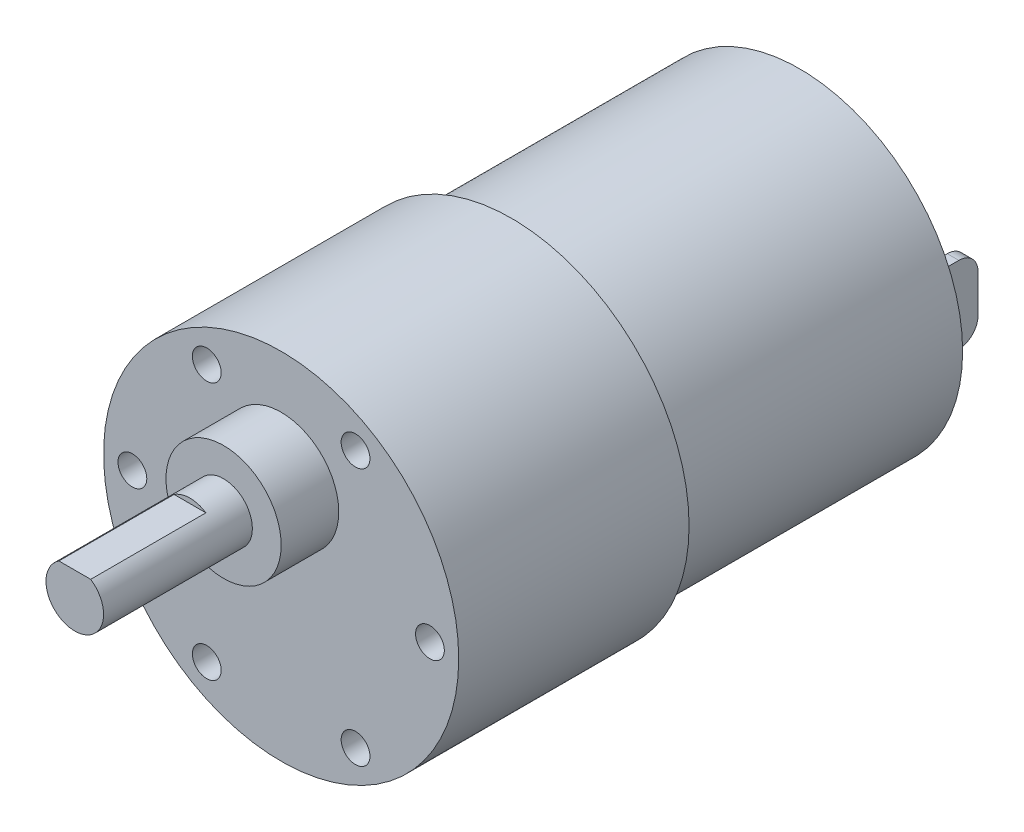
ISO-10303-21;
HEADER;
FILE_DESCRIPTION(('STEP AP214'),'2;1');
FILE_NAME('part.step','',(''),(''),'','','');
FILE_SCHEMA(('AUTOMOTIVE_DESIGN { 1 0 10303 214 1 1 1 1 }'));
ENDSEC;
DATA;
#1=APPLICATION_CONTEXT('core data for automotive mechanical design processes');
#2=APPLICATION_PROTOCOL_DEFINITION('international standard','automotive_design',2000,#1);
#3=PRODUCT_CONTEXT('',#1,'mechanical');
#4=PRODUCT('Part','Part','',(#3));
#5=PRODUCT_RELATED_PRODUCT_CATEGORY('part','',(#4));
#6=PRODUCT_DEFINITION_FORMATION('','',#4);
#7=PRODUCT_DEFINITION_CONTEXT('part definition',#1,'design');
#8=PRODUCT_DEFINITION('design','',#6,#7);
#9=PRODUCT_DEFINITION_SHAPE('','',#8);
#10=(LENGTH_UNIT() NAMED_UNIT(*) SI_UNIT(.MILLI.,.METRE.));
#11=(NAMED_UNIT(*) PLANE_ANGLE_UNIT() SI_UNIT($,.RADIAN.));
#12=(NAMED_UNIT(*) SI_UNIT($,.STERADIAN.) SOLID_ANGLE_UNIT());
#13=UNCERTAINTY_MEASURE_WITH_UNIT(LENGTH_MEASURE(1.E-05),#10,'distance_accuracy_value','');
#14=(GEOMETRIC_REPRESENTATION_CONTEXT(3) GLOBAL_UNCERTAINTY_ASSIGNED_CONTEXT((#13)) GLOBAL_UNIT_ASSIGNED_CONTEXT((#10,
#11,#12)) REPRESENTATION_CONTEXT('',''));
#15=CARTESIAN_POINT('',(0.,0.,0.));
#16=DIRECTION('',(0.,0.,1.));
#17=DIRECTION('',(1.,0.,0.));
#18=AXIS2_PLACEMENT_3D('',#15,#16,#17);
#19=CARTESIAN_POINT('',(0.,0.,24.));
#20=DIRECTION('',(0.,0.,1.));
#21=DIRECTION('',(1.,0.,0.));
#22=AXIS2_PLACEMENT_3D('',#19,#20,#21);
#23=PLANE('',#22);
#24=CARTESIAN_POINT('',(0.,0.,24.));
#25=DIRECTION('',(0.,0.,1.));
#26=DIRECTION('',(-1.,0.,0.));
#27=AXIS2_PLACEMENT_3D('',#24,#25,#26);
#28=CIRCLE('',#27,18.5);
#29=CARTESIAN_POINT('',(18.5,0.,24.));
#30=VERTEX_POINT('',#29);
#31=EDGE_CURVE('E24',#30,#30,#28,.T.);
#32=ORIENTED_EDGE('',*,*,#31,.T.);
#33=EDGE_LOOP('',(#32));
#34=FACE_BOUND('',#33,.T.);
#35=CARTESIAN_POINT('',(-15.5,0.,24.));
#36=DIRECTION('',(0.,0.,-1.));
#37=DIRECTION('',(-1.,0.,0.));
#38=AXIS2_PLACEMENT_3D('',#35,#36,#37);
#39=CIRCLE('',#38,1.5);
#40=CARTESIAN_POINT('',(-14.,0.,24.));
#41=VERTEX_POINT('',#40);
#42=EDGE_CURVE('E261',#41,#41,#39,.T.);
#43=ORIENTED_EDGE('',*,*,#42,.T.);
#44=EDGE_LOOP('',(#43));
#45=FACE_BOUND('',#44,.T.);
#46=CARTESIAN_POINT('',(-7.75,-13.4233937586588,24.));
#47=DIRECTION('',(0.,0.,-1.));
#48=DIRECTION('',(-1.,0.,0.));
#49=AXIS2_PLACEMENT_3D('',#46,#47,#48);
#50=CIRCLE('',#49,1.5);
#51=CARTESIAN_POINT('',(-6.25,-13.4233937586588,24.));
#52=VERTEX_POINT('',#51);
#53=EDGE_CURVE('E205',#52,#52,#50,.T.);
#54=ORIENTED_EDGE('',*,*,#53,.T.);
#55=EDGE_LOOP('',(#54));
#56=FACE_BOUND('',#55,.T.);
#57=CARTESIAN_POINT('',(7.75,-13.4233937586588,24.));
#58=DIRECTION('',(0.,0.,-1.));
#59=DIRECTION('',(-1.,0.,0.));
#60=AXIS2_PLACEMENT_3D('',#57,#58,#59);
#61=CIRCLE('',#60,1.5);
#62=CARTESIAN_POINT('',(9.25,-13.4233937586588,24.));
#63=VERTEX_POINT('',#62);
#64=EDGE_CURVE('E325',#63,#63,#61,.T.);
#65=ORIENTED_EDGE('',*,*,#64,.T.);
#66=EDGE_LOOP('',(#65));
#67=FACE_BOUND('',#66,.T.);
#68=CARTESIAN_POINT('',(15.5,0.,24.));
#69=DIRECTION('',(0.,0.,-1.));
#70=DIRECTION('',(-1.,0.,0.));
#71=AXIS2_PLACEMENT_3D('',#68,#69,#70);
#72=CIRCLE('',#71,1.5);
#73=CARTESIAN_POINT('',(17.,0.,24.));
#74=VERTEX_POINT('',#73);
#75=EDGE_CURVE('E227',#74,#74,#72,.T.);
#76=ORIENTED_EDGE('',*,*,#75,.T.);
#77=EDGE_LOOP('',(#76));
#78=FACE_BOUND('',#77,.T.);
#79=CARTESIAN_POINT('',(7.75,13.4233937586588,24.));
#80=DIRECTION('',(0.,0.,-1.));
#81=DIRECTION('',(-1.,0.,0.));
#82=AXIS2_PLACEMENT_3D('',#79,#80,#81);
#83=CIRCLE('',#82,1.5);
#84=CARTESIAN_POINT('',(9.25,13.4233937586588,24.));
#85=VERTEX_POINT('',#84);
#86=EDGE_CURVE('E225',#85,#85,#83,.T.);
#87=ORIENTED_EDGE('',*,*,#86,.T.);
#88=EDGE_LOOP('',(#87));
#89=FACE_BOUND('',#88,.T.);
#90=CARTESIAN_POINT('',(-7.75,13.4233937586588,24.));
#91=DIRECTION('',(0.,0.,-1.));
#92=DIRECTION('',(-1.,0.,0.));
#93=AXIS2_PLACEMENT_3D('',#90,#91,#92);
#94=CIRCLE('',#93,1.5);
#95=CARTESIAN_POINT('',(-6.25,13.4233937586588,24.));
#96=VERTEX_POINT('',#95);
#97=EDGE_CURVE('E228',#96,#96,#94,.T.);
#98=ORIENTED_EDGE('',*,*,#97,.T.);
#99=EDGE_LOOP('',(#98));
#100=FACE_BOUND('',#99,.T.);
#101=CARTESIAN_POINT('',(0.,7.,24.));
#102=DIRECTION('',(0.,0.,-1.));
#103=DIRECTION('',(-1.,0.,0.));
#104=AXIS2_PLACEMENT_3D('',#101,#102,#103);
#105=CIRCLE('',#104,6.);
#106=CARTESIAN_POINT('',(6.,7.,24.));
#107=VERTEX_POINT('',#106);
#108=EDGE_CURVE('E303',#107,#107,#105,.T.);
#109=ORIENTED_EDGE('',*,*,#108,.T.);
#110=EDGE_LOOP('',(#109));
#111=FACE_BOUND('',#110,.T.);
#112=ADVANCED_FACE('F16',(#34,#45,#56,#67,#78,#89,#100,#111),#23,.T.);
#113=CARTESIAN_POINT('',(0.,0.,0.));
#114=DIRECTION('',(0.,0.,1.));
#115=DIRECTION('',(1.,0.,0.));
#116=AXIS2_PLACEMENT_3D('',#113,#114,#115);
#117=PLANE('',#116);
#118=CARTESIAN_POINT('',(0.,0.,0.));
#119=DIRECTION('',(0.,0.,-1.));
#120=DIRECTION('',(-1.,0.,0.));
#121=AXIS2_PLACEMENT_3D('',#118,#119,#120);
#122=CIRCLE('',#121,18.5);
#123=CARTESIAN_POINT('',(18.5,0.,0.));
#124=VERTEX_POINT('',#123);
#125=EDGE_CURVE('E10',#124,#124,#122,.T.);
#126=ORIENTED_EDGE('',*,*,#125,.T.);
#127=EDGE_LOOP('',(#126));
#128=FACE_BOUND('',#127,.T.);
#129=CARTESIAN_POINT('',(0.,0.,0.));
#130=DIRECTION('',(0.,0.,1.));
#131=DIRECTION('',(1.,0.,0.));
#132=AXIS2_PLACEMENT_3D('',#129,#130,#131);
#133=CIRCLE('',#132,17.);
#134=CARTESIAN_POINT('',(-17.,0.,0.));
#135=VERTEX_POINT('',#134);
#136=EDGE_CURVE('E314',#135,#135,#133,.T.);
#137=ORIENTED_EDGE('',*,*,#136,.T.);
#138=EDGE_LOOP('',(#137));
#139=FACE_BOUND('',#138,.T.);
#140=ADVANCED_FACE('F373',(#128,#139),#117,.F.);
#141=CARTESIAN_POINT('',(0.,0.,0.));
#142=DIRECTION('',(0.,0.,-1.));
#143=DIRECTION('',(-1.,0.,0.));
#144=AXIS2_PLACEMENT_3D('',#141,#142,#143);
#145=CYLINDRICAL_SURFACE('',#144,18.5);
#146=ORIENTED_EDGE('',*,*,#125,.F.);
#147=EDGE_LOOP('',(#146));
#148=FACE_BOUND('',#147,.T.);
#149=ORIENTED_EDGE('',*,*,#31,.F.);
#150=EDGE_LOOP('',(#149));
#151=FACE_BOUND('',#150,.T.);
#152=ADVANCED_FACE('F377',(#148,#151),#145,.T.);
#153=CARTESIAN_POINT('',(-15.5,0.,0.));
#154=DIRECTION('',(0.,0.,-1.));
#155=DIRECTION('',(-1.,0.,0.));
#156=AXIS2_PLACEMENT_3D('',#153,#154,#155);
#157=CYLINDRICAL_SURFACE('',#156,1.5);
#158=ORIENTED_EDGE('',*,*,#42,.F.);
#159=EDGE_LOOP('',(#158));
#160=FACE_BOUND('',#159,.T.);
#161=CARTESIAN_POINT('',(-15.5,0.,12.));
#162=DIRECTION('',(0.,0.,-1.));
#163=DIRECTION('',(-1.,0.,0.));
#164=AXIS2_PLACEMENT_3D('',#161,#162,#163);
#165=CIRCLE('',#164,1.5);
#166=CARTESIAN_POINT('',(-17.,0.,12.));
#167=VERTEX_POINT('',#166);
#168=EDGE_CURVE('E320',#167,#167,#165,.T.);
#169=ORIENTED_EDGE('',*,*,#168,.T.);
#170=EDGE_LOOP('',(#169));
#171=FACE_BOUND('',#170,.T.);
#172=ADVANCED_FACE('F351',(#160,#171),#157,.F.);
#173=CARTESIAN_POINT('',(-7.75,-13.4233937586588,0.));
#174=DIRECTION('',(0.,0.,-1.));
#175=DIRECTION('',(-1.,0.,0.));
#176=AXIS2_PLACEMENT_3D('',#173,#174,#175);
#177=CYLINDRICAL_SURFACE('',#176,1.5);
#178=ORIENTED_EDGE('',*,*,#53,.F.);
#179=EDGE_LOOP('',(#178));
#180=FACE_BOUND('',#179,.T.);
#181=CARTESIAN_POINT('',(-7.75,-13.4233937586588,12.));
#182=DIRECTION('',(0.,0.,-1.));
#183=DIRECTION('',(-1.,0.,0.));
#184=AXIS2_PLACEMENT_3D('',#181,#182,#183);
#185=CIRCLE('',#184,1.5);
#186=CARTESIAN_POINT('',(-9.25,-13.4233937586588,12.));
#187=VERTEX_POINT('',#186);
#188=EDGE_CURVE('E210',#187,#187,#185,.T.);
#189=ORIENTED_EDGE('',*,*,#188,.T.);
#190=EDGE_LOOP('',(#189));
#191=FACE_BOUND('',#190,.T.);
#192=ADVANCED_FACE('F347',(#180,#191),#177,.F.);
#193=CARTESIAN_POINT('',(7.75,-13.4233937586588,0.));
#194=DIRECTION('',(0.,0.,-1.));
#195=DIRECTION('',(-1.,0.,0.));
#196=AXIS2_PLACEMENT_3D('',#193,#194,#195);
#197=CYLINDRICAL_SURFACE('',#196,1.5);
#198=ORIENTED_EDGE('',*,*,#64,.F.);
#199=EDGE_LOOP('',(#198));
#200=FACE_BOUND('',#199,.T.);
#201=CARTESIAN_POINT('',(7.75,-13.4233937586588,12.));
#202=DIRECTION('',(0.,0.,-1.));
#203=DIRECTION('',(-1.,0.,0.));
#204=AXIS2_PLACEMENT_3D('',#201,#202,#203);
#205=CIRCLE('',#204,1.5);
#206=CARTESIAN_POINT('',(6.25,-13.4233937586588,12.));
#207=VERTEX_POINT('',#206);
#208=EDGE_CURVE('E318',#207,#207,#205,.T.);
#209=ORIENTED_EDGE('',*,*,#208,.T.);
#210=EDGE_LOOP('',(#209));
#211=FACE_BOUND('',#210,.T.);
#212=ADVANCED_FACE('F350',(#200,#211),#197,.F.);
#213=CARTESIAN_POINT('',(15.5,0.,0.));
#214=DIRECTION('',(0.,0.,-1.));
#215=DIRECTION('',(-1.,0.,0.));
#216=AXIS2_PLACEMENT_3D('',#213,#214,#215);
#217=CYLINDRICAL_SURFACE('',#216,1.5);
#218=ORIENTED_EDGE('',*,*,#75,.F.);
#219=EDGE_LOOP('',(#218));
#220=FACE_BOUND('',#219,.T.);
#221=CARTESIAN_POINT('',(15.5,0.,12.));
#222=DIRECTION('',(0.,0.,-1.));
#223=DIRECTION('',(-1.,0.,0.));
#224=AXIS2_PLACEMENT_3D('',#221,#222,#223);
#225=CIRCLE('',#224,1.5);
#226=CARTESIAN_POINT('',(14.,0.,12.));
#227=VERTEX_POINT('',#226);
#228=EDGE_CURVE('E211',#227,#227,#225,.T.);
#229=ORIENTED_EDGE('',*,*,#228,.T.);
#230=EDGE_LOOP('',(#229));
#231=FACE_BOUND('',#230,.T.);
#232=ADVANCED_FACE('F387',(#220,#231),#217,.F.);
#233=CARTESIAN_POINT('',(7.75,13.4233937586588,0.));
#234=DIRECTION('',(0.,0.,-1.));
#235=DIRECTION('',(-1.,0.,0.));
#236=AXIS2_PLACEMENT_3D('',#233,#234,#235);
#237=CYLINDRICAL_SURFACE('',#236,1.5);
#238=ORIENTED_EDGE('',*,*,#86,.F.);
#239=EDGE_LOOP('',(#238));
#240=FACE_BOUND('',#239,.T.);
#241=CARTESIAN_POINT('',(7.75,13.4233937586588,12.));
#242=DIRECTION('',(0.,0.,-1.));
#243=DIRECTION('',(-1.,0.,0.));
#244=AXIS2_PLACEMENT_3D('',#241,#242,#243);
#245=CIRCLE('',#244,1.5);
#246=CARTESIAN_POINT('',(6.25,13.4233937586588,12.));
#247=VERTEX_POINT('',#246);
#248=EDGE_CURVE('E322',#247,#247,#245,.T.);
#249=ORIENTED_EDGE('',*,*,#248,.T.);
#250=EDGE_LOOP('',(#249));
#251=FACE_BOUND('',#250,.T.);
#252=ADVANCED_FACE('F390',(#240,#251),#237,.F.);
#253=CARTESIAN_POINT('',(-7.75,13.4233937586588,0.));
#254=DIRECTION('',(0.,0.,-1.));
#255=DIRECTION('',(-1.,0.,0.));
#256=AXIS2_PLACEMENT_3D('',#253,#254,#255);
#257=CYLINDRICAL_SURFACE('',#256,1.5);
#258=ORIENTED_EDGE('',*,*,#97,.F.);
#259=EDGE_LOOP('',(#258));
#260=FACE_BOUND('',#259,.T.);
#261=CARTESIAN_POINT('',(-7.75,13.4233937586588,12.));
#262=DIRECTION('',(0.,0.,-1.));
#263=DIRECTION('',(-1.,0.,0.));
#264=AXIS2_PLACEMENT_3D('',#261,#262,#263);
#265=CIRCLE('',#264,1.5);
#266=CARTESIAN_POINT('',(-9.25,13.4233937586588,12.));
#267=VERTEX_POINT('',#266);
#268=EDGE_CURVE('E212',#267,#267,#265,.T.);
#269=ORIENTED_EDGE('',*,*,#268,.T.);
#270=EDGE_LOOP('',(#269));
#271=FACE_BOUND('',#270,.T.);
#272=ADVANCED_FACE('F394',(#260,#271),#257,.F.);
#273=CARTESIAN_POINT('',(0.,7.,30.));
#274=DIRECTION('',(0.,0.,1.));
#275=DIRECTION('',(1.,0.,0.));
#276=AXIS2_PLACEMENT_3D('',#273,#274,#275);
#277=PLANE('',#276);
#278=CARTESIAN_POINT('',(0.,7.,30.));
#279=DIRECTION('',(0.,0.,1.));
#280=DIRECTION('',(-1.,0.,0.));
#281=AXIS2_PLACEMENT_3D('',#278,#279,#280);
#282=CIRCLE('',#281,6.);
#283=CARTESIAN_POINT('',(6.,7.,30.));
#284=VERTEX_POINT('',#283);
#285=EDGE_CURVE('E300',#284,#284,#282,.T.);
#286=ORIENTED_EDGE('',*,*,#285,.T.);
#287=EDGE_LOOP('',(#286));
#288=FACE_BOUND('',#287,.T.);
#289=CARTESIAN_POINT('',(0.,7.,30.));
#290=DIRECTION('',(0.,0.,-1.));
#291=DIRECTION('',(-1.,0.,0.));
#292=AXIS2_PLACEMENT_3D('',#289,#290,#291);
#293=CIRCLE('',#292,3.);
#294=CARTESIAN_POINT('',(3.,7.,30.));
#295=VERTEX_POINT('',#294);
#296=EDGE_CURVE('E336',#295,#295,#293,.T.);
#297=ORIENTED_EDGE('',*,*,#296,.T.);
#298=EDGE_LOOP('',(#297));
#299=FACE_BOUND('',#298,.T.);
#300=ADVANCED_FACE('F398',(#288,#299),#277,.T.);
#301=CARTESIAN_POINT('',(0.,7.,24.));
#302=DIRECTION('',(0.,0.,-1.));
#303=DIRECTION('',(-1.,0.,0.));
#304=AXIS2_PLACEMENT_3D('',#301,#302,#303);
#305=CYLINDRICAL_SURFACE('',#304,6.);
#306=ORIENTED_EDGE('',*,*,#108,.F.);
#307=EDGE_LOOP('',(#306));
#308=FACE_BOUND('',#307,.T.);
#309=ORIENTED_EDGE('',*,*,#285,.F.);
#310=EDGE_LOOP('',(#309));
#311=FACE_BOUND('',#310,.T.);
#312=ADVANCED_FACE('F402',(#308,#311),#305,.T.);
#313=CARTESIAN_POINT('',(0.,7.,45.5));
#314=DIRECTION('',(0.,0.,1.));
#315=DIRECTION('',(1.,0.,0.));
#316=AXIS2_PLACEMENT_3D('',#313,#314,#315);
#317=PLANE('',#316);
#318=DIRECTION('',(-1.,0.,0.));
#319=VECTOR('',#318,1.);
#320=CARTESIAN_POINT('',(0.829156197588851,9.5,45.5));
#321=LINE('',#320,#319);
#322=CARTESIAN_POINT('',(1.6583123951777,9.5,45.5));
#323=VERTEX_POINT('',#322);
#324=CARTESIAN_POINT('',(-1.6583123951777,9.5,45.5));
#325=VERTEX_POINT('',#324);
#326=EDGE_CURVE('E324',#323,#325,#321,.T.);
#327=ORIENTED_EDGE('',*,*,#326,.T.);
#328=CARTESIAN_POINT('',(0.,7.,45.5));
#329=DIRECTION('',(0.,0.,1.));
#330=DIRECTION('',(-1.,0.,0.));
#331=AXIS2_PLACEMENT_3D('',#328,#329,#330);
#332=CIRCLE('',#331,3.);
#333=EDGE_CURVE('E304',#325,#323,#332,.T.);
#334=ORIENTED_EDGE('',*,*,#333,.T.);
#335=EDGE_LOOP('',(#327,#334));
#336=FACE_BOUND('',#335,.T.);
#337=ADVANCED_FACE('F406',(#336),#317,.T.);
#338=CARTESIAN_POINT('',(0.,7.,30.));
#339=DIRECTION('',(0.,0.,-1.));
#340=DIRECTION('',(-1.,0.,0.));
#341=AXIS2_PLACEMENT_3D('',#338,#339,#340);
#342=CYLINDRICAL_SURFACE('',#341,3.);
#343=DIRECTION('',(0.,0.,-1.));
#344=VECTOR('',#343,1.);
#345=CARTESIAN_POINT('',(-1.6583123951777,9.5,30.));
#346=LINE('',#345,#344);
#347=CARTESIAN_POINT('',(-1.6583123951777,9.5,33.5));
#348=VERTEX_POINT('',#347);
#349=EDGE_CURVE('E283',#325,#348,#346,.T.);
#350=ORIENTED_EDGE('',*,*,#349,.T.);
#351=CARTESIAN_POINT('',(0.,7.,33.5));
#352=DIRECTION('',(0.,0.,-1.));
#353=DIRECTION('',(-1.,0.,0.));
#354=AXIS2_PLACEMENT_3D('',#351,#352,#353);
#355=CIRCLE('',#354,3.);
#356=CARTESIAN_POINT('',(1.6583123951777,9.5,33.5));
#357=VERTEX_POINT('',#356);
#358=EDGE_CURVE('E286',#348,#357,#355,.T.);
#359=ORIENTED_EDGE('',*,*,#358,.T.);
#360=DIRECTION('',(0.,0.,1.));
#361=VECTOR('',#360,1.);
#362=CARTESIAN_POINT('',(1.6583123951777,9.5,30.));
#363=LINE('',#362,#361);
#364=EDGE_CURVE('E329',#357,#323,#363,.T.);
#365=ORIENTED_EDGE('',*,*,#364,.T.);
#366=ORIENTED_EDGE('',*,*,#333,.F.);
#367=EDGE_LOOP('',(#350,#359,#365,#366));
#368=FACE_BOUND('',#367,.T.);
#369=ORIENTED_EDGE('',*,*,#296,.F.);
#370=EDGE_LOOP('',(#369));
#371=FACE_BOUND('',#370,.T.);
#372=ADVANCED_FACE('F410',(#368,#371),#342,.T.);
#373=CARTESIAN_POINT('',(0.,9.6467429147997,33.5));
#374=DIRECTION('',(0.,0.,1.));
#375=DIRECTION('',(1.,0.,0.));
#376=AXIS2_PLACEMENT_3D('',#373,#374,#375);
#377=PLANE('',#376);
#378=ORIENTED_EDGE('',*,*,#358,.F.);
#379=DIRECTION('',(-1.,0.,0.));
#380=VECTOR('',#379,1.);
#381=CARTESIAN_POINT('',(-3.37142139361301,9.5,33.5));
#382=LINE('',#381,#380);
#383=EDGE_CURVE('E287',#357,#348,#382,.T.);
#384=ORIENTED_EDGE('',*,*,#383,.F.);
#385=EDGE_LOOP('',(#378,#384));
#386=FACE_BOUND('',#385,.T.);
#387=ADVANCED_FACE('F414',(#386),#377,.T.);
#388=CARTESIAN_POINT('',(1.6583123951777,9.5,45.5));
#389=DIRECTION('',(0.,-1.,0.));
#390=DIRECTION('',(-1.,0.,0.));
#391=AXIS2_PLACEMENT_3D('',#388,#389,#390);
#392=PLANE('',#391);
#393=ORIENTED_EDGE('',*,*,#326,.F.);
#394=ORIENTED_EDGE('',*,*,#364,.F.);
#395=ORIENTED_EDGE('',*,*,#383,.T.);
#396=ORIENTED_EDGE('',*,*,#349,.F.);
#397=EDGE_LOOP('',(#393,#394,#395,#396));
#398=FACE_BOUND('',#397,.T.);
#399=ADVANCED_FACE('F418',(#398),#392,.F.);
#400=CARTESIAN_POINT('',(7.75,13.4233937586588,12.));
#401=DIRECTION('',(0.,0.,1.));
#402=DIRECTION('',(1.,0.,0.));
#403=AXIS2_PLACEMENT_3D('',#400,#401,#402);
#404=PLANE('',#403);
#405=ORIENTED_EDGE('',*,*,#248,.F.);
#406=EDGE_LOOP('',(#405));
#407=FACE_BOUND('',#406,.T.);
#408=ADVANCED_FACE('F422',(#407),#404,.T.);
#409=CARTESIAN_POINT('',(-15.5,0.,12.));
#410=DIRECTION('',(0.,0.,1.));
#411=DIRECTION('',(1.,0.,0.));
#412=AXIS2_PLACEMENT_3D('',#409,#410,#411);
#413=PLANE('',#412);
#414=ORIENTED_EDGE('',*,*,#168,.F.);
#415=EDGE_LOOP('',(#414));
#416=FACE_BOUND('',#415,.T.);
#417=ADVANCED_FACE('F426',(#416),#413,.T.);
#418=CARTESIAN_POINT('',(7.75,-13.4233937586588,12.));
#419=DIRECTION('',(0.,0.,1.));
#420=DIRECTION('',(1.,0.,0.));
#421=AXIS2_PLACEMENT_3D('',#418,#419,#420);
#422=PLANE('',#421);
#423=ORIENTED_EDGE('',*,*,#208,.F.);
#424=EDGE_LOOP('',(#423));
#425=FACE_BOUND('',#424,.T.);
#426=ADVANCED_FACE('F368',(#425),#422,.T.);
#427=CARTESIAN_POINT('',(15.5,0.,12.));
#428=DIRECTION('',(0.,0.,1.));
#429=DIRECTION('',(1.,0.,0.));
#430=AXIS2_PLACEMENT_3D('',#427,#428,#429);
#431=PLANE('',#430);
#432=ORIENTED_EDGE('',*,*,#228,.F.);
#433=EDGE_LOOP('',(#432));
#434=FACE_BOUND('',#433,.T.);
#435=ADVANCED_FACE('F358',(#434),#431,.T.);
#436=CARTESIAN_POINT('',(-7.75,-13.4233937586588,12.));
#437=DIRECTION('',(0.,0.,1.));
#438=DIRECTION('',(1.,0.,0.));
#439=AXIS2_PLACEMENT_3D('',#436,#437,#438);
#440=PLANE('',#439);
#441=ORIENTED_EDGE('',*,*,#188,.F.);
#442=EDGE_LOOP('',(#441));
#443=FACE_BOUND('',#442,.T.);
#444=ADVANCED_FACE('F355',(#443),#440,.T.);
#445=CARTESIAN_POINT('',(-7.75,13.4233937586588,12.));
#446=DIRECTION('',(0.,0.,1.));
#447=DIRECTION('',(1.,0.,0.));
#448=AXIS2_PLACEMENT_3D('',#445,#446,#447);
#449=PLANE('',#448);
#450=ORIENTED_EDGE('',*,*,#268,.F.);
#451=EDGE_LOOP('',(#450));
#452=FACE_BOUND('',#451,.T.);
#453=ADVANCED_FACE('F357',(#452),#449,.T.);
#454=CARTESIAN_POINT('',(0.,0.,-30.));
#455=DIRECTION('',(0.,0.,1.));
#456=DIRECTION('',(1.,0.,0.));
#457=AXIS2_PLACEMENT_3D('',#454,#455,#456);
#458=PLANE('',#457);
#459=CARTESIAN_POINT('',(0.,0.,-30.));
#460=DIRECTION('',(0.,0.,-1.));
#461=DIRECTION('',(1.,0.,0.));
#462=AXIS2_PLACEMENT_3D('',#459,#460,#461);
#463=CIRCLE('',#462,17.);
#464=CARTESIAN_POINT('',(-17.,0.,-30.));
#465=VERTEX_POINT('',#464);
#466=EDGE_CURVE('E311',#465,#465,#463,.T.);
#467=ORIENTED_EDGE('',*,*,#466,.T.);
#468=EDGE_LOOP('',(#467));
#469=FACE_BOUND('',#468,.T.);
#470=DIRECTION('',(0.,1.,0.));
#471=VECTOR('',#470,1.);
#472=CARTESIAN_POINT('',(-11.4,2.,-30.));
#473=LINE('',#472,#471);
#474=CARTESIAN_POINT('',(-11.4,-4.,-30.));
#475=VERTEX_POINT('',#474);
#476=CARTESIAN_POINT('',(-11.4,4.,-30.));
#477=VERTEX_POINT('',#476);
#478=EDGE_CURVE('E241',#475,#477,#473,.T.);
#479=ORIENTED_EDGE('',*,*,#478,.T.);
#480=DIRECTION('',(-1.,0.,0.));
#481=VECTOR('',#480,1.);
#482=CARTESIAN_POINT('',(-6.3,4.,-30.));
#483=LINE('',#482,#481);
#484=CARTESIAN_POINT('',(-12.6,4.,-30.));
#485=VERTEX_POINT('',#484);
#486=EDGE_CURVE('E221',#477,#485,#483,.T.);
#487=ORIENTED_EDGE('',*,*,#486,.T.);
#488=DIRECTION('',(0.,-1.,0.));
#489=VECTOR('',#488,1.);
#490=CARTESIAN_POINT('',(-12.6,-2.,-30.));
#491=LINE('',#490,#489);
#492=CARTESIAN_POINT('',(-12.6,-4.,-30.));
#493=VERTEX_POINT('',#492);
#494=EDGE_CURVE('E244',#485,#493,#491,.T.);
#495=ORIENTED_EDGE('',*,*,#494,.T.);
#496=DIRECTION('',(1.,0.,0.));
#497=VECTOR('',#496,1.);
#498=CARTESIAN_POINT('',(-5.7,-4.,-30.));
#499=LINE('',#498,#497);
#500=EDGE_CURVE('E250',#493,#475,#499,.T.);
#501=ORIENTED_EDGE('',*,*,#500,.T.);
#502=EDGE_LOOP('',(#479,#487,#495,#501));
#503=FACE_BOUND('',#502,.T.);
#504=DIRECTION('',(0.,1.,0.));
#505=VECTOR('',#504,1.);
#506=CARTESIAN_POINT('',(12.6,2.,-30.));
#507=LINE('',#506,#505);
#508=CARTESIAN_POINT('',(12.6,-4.,-30.));
#509=VERTEX_POINT('',#508);
#510=CARTESIAN_POINT('',(12.6,4.,-30.));
#511=VERTEX_POINT('',#510);
#512=EDGE_CURVE('E271',#509,#511,#507,.T.);
#513=ORIENTED_EDGE('',*,*,#512,.T.);
#514=DIRECTION('',(-1.,0.,0.));
#515=VECTOR('',#514,1.);
#516=CARTESIAN_POINT('',(5.7,4.,-30.));
#517=LINE('',#516,#515);
#518=CARTESIAN_POINT('',(11.4,4.,-30.));
#519=VERTEX_POINT('',#518);
#520=EDGE_CURVE('E181',#511,#519,#517,.T.);
#521=ORIENTED_EDGE('',*,*,#520,.T.);
#522=DIRECTION('',(0.,-1.,0.));
#523=VECTOR('',#522,1.);
#524=CARTESIAN_POINT('',(11.4,-2.,-30.));
#525=LINE('',#524,#523);
#526=CARTESIAN_POINT('',(11.4,-4.,-30.));
#527=VERTEX_POINT('',#526);
#528=EDGE_CURVE('E180',#519,#527,#525,.T.);
#529=ORIENTED_EDGE('',*,*,#528,.T.);
#530=DIRECTION('',(1.,0.,0.));
#531=VECTOR('',#530,1.);
#532=CARTESIAN_POINT('',(6.3,-4.,-30.));
#533=LINE('',#532,#531);
#534=EDGE_CURVE('E175',#527,#509,#533,.T.);
#535=ORIENTED_EDGE('',*,*,#534,.T.);
#536=EDGE_LOOP('',(#513,#521,#529,#535));
#537=FACE_BOUND('',#536,.T.);
#538=ADVANCED_FACE('F365',(#469,#503,#537),#458,.F.);
#539=CARTESIAN_POINT('',(0.,0.,0.));
#540=DIRECTION('',(0.,0.,1.));
#541=DIRECTION('',(1.,0.,0.));
#542=AXIS2_PLACEMENT_3D('',#539,#540,#541);
#543=CYLINDRICAL_SURFACE('',#542,17.);
#544=ORIENTED_EDGE('',*,*,#136,.F.);
#545=EDGE_LOOP('',(#544));
#546=FACE_BOUND('',#545,.T.);
#547=ORIENTED_EDGE('',*,*,#466,.F.);
#548=EDGE_LOOP('',(#547));
#549=FACE_BOUND('',#548,.T.);
#550=ADVANCED_FACE('F483',(#546,#549),#543,.T.);
#551=CARTESIAN_POINT('',(-11.4,-4.,-30.));
#552=DIRECTION('',(0.,-1.,0.));
#553=DIRECTION('',(-1.,0.,0.));
#554=AXIS2_PLACEMENT_3D('',#551,#552,#553);
#555=PLANE('',#554);
#556=DIRECTION('',(-1.,0.,0.));
#557=VECTOR('',#556,1.);
#558=CARTESIAN_POINT('',(-11.7,-4.,-34.));
#559=LINE('',#558,#557);
#560=CARTESIAN_POINT('',(-11.4,-4.,-34.));
#561=VERTEX_POINT('',#560);
#562=CARTESIAN_POINT('',(-12.6,-4.,-34.));
#563=VERTEX_POINT('',#562);
#564=EDGE_CURVE('E223',#561,#563,#559,.T.);
#565=ORIENTED_EDGE('',*,*,#564,.F.);
#566=DIRECTION('',(0.,0.,-1.));
#567=VECTOR('',#566,1.);
#568=CARTESIAN_POINT('',(-11.4,-4.,-30.));
#569=LINE('',#568,#567);
#570=EDGE_CURVE('E238',#475,#561,#569,.T.);
#571=ORIENTED_EDGE('',*,*,#570,.F.);
#572=ORIENTED_EDGE('',*,*,#500,.F.);
#573=DIRECTION('',(0.,0.,-1.));
#574=VECTOR('',#573,1.);
#575=CARTESIAN_POINT('',(-12.6,-4.,-30.));
#576=LINE('',#575,#574);
#577=EDGE_CURVE('E231',#493,#563,#576,.T.);
#578=ORIENTED_EDGE('',*,*,#577,.T.);
#579=EDGE_LOOP('',(#565,#571,#572,#578));
#580=FACE_BOUND('',#579,.T.);
#581=ADVANCED_FACE('F456',(#580),#555,.T.);
#582=CARTESIAN_POINT('',(-12.6,-4.,-30.));
#583=DIRECTION('',(-1.,0.,0.));
#584=DIRECTION('',(0.,1.,0.));
#585=AXIS2_PLACEMENT_3D('',#582,#583,#584);
#586=PLANE('',#585);
#587=CARTESIAN_POINT('',(-12.6,-2.,-34.));
#588=DIRECTION('',(1.,0.,0.));
#589=DIRECTION('',(0.,-0.707106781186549,-0.707106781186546));
#590=AXIS2_PLACEMENT_3D('',#587,#588,#589);
#591=CIRCLE('',#590,2.);
#592=CARTESIAN_POINT('',(-12.6,-2.,-36.));
#593=VERTEX_POINT('',#592);
#594=EDGE_CURVE('E206',#563,#593,#591,.T.);
#595=ORIENTED_EDGE('',*,*,#594,.F.);
#596=ORIENTED_EDGE('',*,*,#577,.F.);
#597=ORIENTED_EDGE('',*,*,#494,.F.);
#598=DIRECTION('',(0.,0.,-1.));
#599=VECTOR('',#598,1.);
#600=CARTESIAN_POINT('',(-12.6,4.,-30.));
#601=LINE('',#600,#599);
#602=CARTESIAN_POINT('',(-12.6,4.,-34.));
#603=VERTEX_POINT('',#602);
#604=EDGE_CURVE('E218',#485,#603,#601,.T.);
#605=ORIENTED_EDGE('',*,*,#604,.T.);
#606=CARTESIAN_POINT('',(-12.6,2.,-34.));
#607=DIRECTION('',(1.,0.,0.));
#608=DIRECTION('',(0.,0.707106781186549,-0.707106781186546));
#609=AXIS2_PLACEMENT_3D('',#606,#607,#608);
#610=CIRCLE('',#609,2.);
#611=CARTESIAN_POINT('',(-12.6,2.,-36.));
#612=VERTEX_POINT('',#611);
#613=EDGE_CURVE('E292',#612,#603,#610,.T.);
#614=ORIENTED_EDGE('',*,*,#613,.F.);
#615=DIRECTION('',(0.,1.,0.));
#616=VECTOR('',#615,1.);
#617=CARTESIAN_POINT('',(-12.6,-4.,-36.));
#618=LINE('',#617,#616);
#619=EDGE_CURVE('E201',#593,#612,#618,.T.);
#620=ORIENTED_EDGE('',*,*,#619,.F.);
#621=EDGE_LOOP('',(#595,#596,#597,#605,#614,#620));
#622=FACE_BOUND('',#621,.T.);
#623=ADVANCED_FACE('F452',(#622),#586,.T.);
#624=CARTESIAN_POINT('',(-12.6,4.,-30.));
#625=DIRECTION('',(0.,1.,0.));
#626=DIRECTION('',(1.,0.,0.));
#627=AXIS2_PLACEMENT_3D('',#624,#625,#626);
#628=PLANE('',#627);
#629=DIRECTION('',(1.,0.,0.));
#630=VECTOR('',#629,1.);
#631=CARTESIAN_POINT('',(-12.3,4.,-34.));
#632=LINE('',#631,#630);
#633=CARTESIAN_POINT('',(-11.4,4.,-34.));
#634=VERTEX_POINT('',#633);
#635=EDGE_CURVE('E295',#603,#634,#632,.T.);
#636=ORIENTED_EDGE('',*,*,#635,.F.);
#637=ORIENTED_EDGE('',*,*,#604,.F.);
#638=ORIENTED_EDGE('',*,*,#486,.F.);
#639=DIRECTION('',(0.,0.,-1.));
#640=VECTOR('',#639,1.);
#641=CARTESIAN_POINT('',(-11.4,4.,-30.));
#642=LINE('',#641,#640);
#643=EDGE_CURVE('E253',#477,#634,#642,.T.);
#644=ORIENTED_EDGE('',*,*,#643,.T.);
#645=EDGE_LOOP('',(#636,#637,#638,#644));
#646=FACE_BOUND('',#645,.T.);
#647=ADVANCED_FACE('F455',(#646),#628,.T.);
#648=CARTESIAN_POINT('',(12.6,-4.,-30.));
#649=DIRECTION('',(0.,-1.,0.));
#650=DIRECTION('',(-1.,0.,0.));
#651=AXIS2_PLACEMENT_3D('',#648,#649,#650);
#652=PLANE('',#651);
#653=DIRECTION('',(-1.,0.,0.));
#654=VECTOR('',#653,1.);
#655=CARTESIAN_POINT('',(12.3,-4.,-34.));
#656=LINE('',#655,#654);
#657=CARTESIAN_POINT('',(12.6,-4.,-34.));
#658=VERTEX_POINT('',#657);
#659=CARTESIAN_POINT('',(11.4,-4.,-34.));
#660=VERTEX_POINT('',#659);
#661=EDGE_CURVE('E173',#658,#660,#656,.T.);
#662=ORIENTED_EDGE('',*,*,#661,.F.);
#663=DIRECTION('',(0.,0.,-1.));
#664=VECTOR('',#663,1.);
#665=CARTESIAN_POINT('',(12.6,-4.,-30.));
#666=LINE('',#665,#664);
#667=EDGE_CURVE('E274',#509,#658,#666,.T.);
#668=ORIENTED_EDGE('',*,*,#667,.F.);
#669=ORIENTED_EDGE('',*,*,#534,.F.);
#670=DIRECTION('',(0.,0.,-1.));
#671=VECTOR('',#670,1.);
#672=CARTESIAN_POINT('',(11.4,-4.,-30.));
#673=LINE('',#672,#671);
#674=EDGE_CURVE('E169',#527,#660,#673,.T.);
#675=ORIENTED_EDGE('',*,*,#674,.T.);
#676=EDGE_LOOP('',(#662,#668,#669,#675));
#677=FACE_BOUND('',#676,.T.);
#678=ADVANCED_FACE('F171',(#677),#652,.T.);
#679=CARTESIAN_POINT('',(11.4,-4.,-30.));
#680=DIRECTION('',(-1.,0.,0.));
#681=DIRECTION('',(0.,1.,0.));
#682=AXIS2_PLACEMENT_3D('',#679,#680,#681);
#683=PLANE('',#682);
#684=CARTESIAN_POINT('',(11.4,-2.,-34.));
#685=DIRECTION('',(1.,0.,0.));
#686=DIRECTION('',(0.,-0.707106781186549,-0.707106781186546));
#687=AXIS2_PLACEMENT_3D('',#684,#685,#686);
#688=CIRCLE('',#687,2.);
#689=CARTESIAN_POINT('',(11.4,-2.,-36.));
#690=VERTEX_POINT('',#689);
#691=EDGE_CURVE('E187',#660,#690,#688,.T.);
#692=ORIENTED_EDGE('',*,*,#691,.F.);
#693=ORIENTED_EDGE('',*,*,#674,.F.);
#694=ORIENTED_EDGE('',*,*,#528,.F.);
#695=DIRECTION('',(0.,0.,-1.));
#696=VECTOR('',#695,1.);
#697=CARTESIAN_POINT('',(11.4,4.,-30.));
#698=LINE('',#697,#696);
#699=CARTESIAN_POINT('',(11.4,4.,-34.));
#700=VERTEX_POINT('',#699);
#701=EDGE_CURVE('E297',#519,#700,#698,.T.);
#702=ORIENTED_EDGE('',*,*,#701,.T.);
#703=CARTESIAN_POINT('',(11.4,2.,-34.));
#704=DIRECTION('',(1.,0.,0.));
#705=DIRECTION('',(0.,0.707106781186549,-0.707106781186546));
#706=AXIS2_PLACEMENT_3D('',#703,#704,#705);
#707=CIRCLE('',#706,2.);
#708=CARTESIAN_POINT('',(11.4,2.,-36.));
#709=VERTEX_POINT('',#708);
#710=EDGE_CURVE('E282',#709,#700,#707,.T.);
#711=ORIENTED_EDGE('',*,*,#710,.F.);
#712=DIRECTION('',(0.,1.,0.));
#713=VECTOR('',#712,1.);
#714=CARTESIAN_POINT('',(11.4,-4.,-36.));
#715=LINE('',#714,#713);
#716=EDGE_CURVE('E194',#690,#709,#715,.T.);
#717=ORIENTED_EDGE('',*,*,#716,.F.);
#718=EDGE_LOOP('',(#692,#693,#694,#702,#711,#717));
#719=FACE_BOUND('',#718,.T.);
#720=ADVANCED_FACE('F192',(#719),#683,.T.);
#721=CARTESIAN_POINT('',(11.4,4.,-30.));
#722=DIRECTION('',(0.,1.,0.));
#723=DIRECTION('',(1.,0.,0.));
#724=AXIS2_PLACEMENT_3D('',#721,#722,#723);
#725=PLANE('',#724);
#726=DIRECTION('',(1.,0.,0.));
#727=VECTOR('',#726,1.);
#728=CARTESIAN_POINT('',(11.7,4.,-34.));
#729=LINE('',#728,#727);
#730=CARTESIAN_POINT('',(12.6,4.,-34.));
#731=VERTEX_POINT('',#730);
#732=EDGE_CURVE('E290',#700,#731,#729,.T.);
#733=ORIENTED_EDGE('',*,*,#732,.F.);
#734=ORIENTED_EDGE('',*,*,#701,.F.);
#735=ORIENTED_EDGE('',*,*,#520,.F.);
#736=DIRECTION('',(0.,0.,-1.));
#737=VECTOR('',#736,1.);
#738=CARTESIAN_POINT('',(12.6,4.,-30.));
#739=LINE('',#738,#737);
#740=EDGE_CURVE('E267',#511,#731,#739,.T.);
#741=ORIENTED_EDGE('',*,*,#740,.T.);
#742=EDGE_LOOP('',(#733,#734,#735,#741));
#743=FACE_BOUND('',#742,.T.);
#744=ADVANCED_FACE('F458',(#743),#725,.T.);
#745=CARTESIAN_POINT('',(-12.3,2.,-34.));
#746=DIRECTION('',(-1.,0.,0.));
#747=DIRECTION('',(0.,0.707106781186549,-0.707106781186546));
#748=AXIS2_PLACEMENT_3D('',#745,#746,#747);
#749=CYLINDRICAL_SURFACE('',#748,2.);
#750=CARTESIAN_POINT('',(-11.4,2.,-34.));
#751=DIRECTION('',(-1.,0.,0.));
#752=DIRECTION('',(0.,0.707106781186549,-0.707106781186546));
#753=AXIS2_PLACEMENT_3D('',#750,#751,#752);
#754=CIRCLE('',#753,2.);
#755=CARTESIAN_POINT('',(-11.4,2.,-36.));
#756=VERTEX_POINT('',#755);
#757=EDGE_CURVE('E247',#634,#756,#754,.T.);
#758=ORIENTED_EDGE('',*,*,#757,.T.);
#759=DIRECTION('',(-1.,0.,0.));
#760=VECTOR('',#759,1.);
#761=CARTESIAN_POINT('',(-12.3,2.,-36.));
#762=LINE('',#761,#760);
#763=EDGE_CURVE('E197',#756,#612,#762,.T.);
#764=ORIENTED_EDGE('',*,*,#763,.T.);
#765=ORIENTED_EDGE('',*,*,#613,.T.);
#766=ORIENTED_EDGE('',*,*,#635,.T.);
#767=EDGE_LOOP('',(#758,#764,#765,#766));
#768=FACE_BOUND('',#767,.T.);
#769=ADVANCED_FACE('F461',(#768),#749,.T.);
#770=CARTESIAN_POINT('',(11.7,2.,-34.));
#771=DIRECTION('',(-1.,0.,0.));
#772=DIRECTION('',(0.,0.707106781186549,-0.707106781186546));
#773=AXIS2_PLACEMENT_3D('',#770,#771,#772);
#774=CYLINDRICAL_SURFACE('',#773,2.);
#775=CARTESIAN_POINT('',(12.6,2.,-34.));
#776=DIRECTION('',(-1.,0.,0.));
#777=DIRECTION('',(0.,0.707106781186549,-0.707106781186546));
#778=AXIS2_PLACEMENT_3D('',#775,#776,#777);
#779=CIRCLE('',#778,2.);
#780=CARTESIAN_POINT('',(12.6,2.,-36.));
#781=VERTEX_POINT('',#780);
#782=EDGE_CURVE('E237',#731,#781,#779,.T.);
#783=ORIENTED_EDGE('',*,*,#782,.T.);
#784=DIRECTION('',(-1.,0.,0.));
#785=VECTOR('',#784,1.);
#786=CARTESIAN_POINT('',(11.7,2.,-36.));
#787=LINE('',#786,#785);
#788=EDGE_CURVE('E279',#781,#709,#787,.T.);
#789=ORIENTED_EDGE('',*,*,#788,.T.);
#790=ORIENTED_EDGE('',*,*,#710,.T.);
#791=ORIENTED_EDGE('',*,*,#732,.T.);
#792=EDGE_LOOP('',(#783,#789,#790,#791));
#793=FACE_BOUND('',#792,.T.);
#794=ADVANCED_FACE('F470',(#793),#774,.T.);
#795=CARTESIAN_POINT('',(12.,0.,-36.));
#796=DIRECTION('',(0.,0.,-1.));
#797=DIRECTION('',(-1.,0.,0.));
#798=AXIS2_PLACEMENT_3D('',#795,#796,#797);
#799=PLANE('',#798);
#800=DIRECTION('',(1.,0.,0.));
#801=VECTOR('',#800,1.);
#802=CARTESIAN_POINT('',(12.3,-2.,-36.));
#803=LINE('',#802,#801);
#804=CARTESIAN_POINT('',(12.6,-2.,-36.));
#805=VERTEX_POINT('',#804);
#806=EDGE_CURVE('E196',#690,#805,#803,.T.);
#807=ORIENTED_EDGE('',*,*,#806,.F.);
#808=ORIENTED_EDGE('',*,*,#716,.T.);
#809=ORIENTED_EDGE('',*,*,#788,.F.);
#810=DIRECTION('',(0.,-1.,0.));
#811=VECTOR('',#810,1.);
#812=CARTESIAN_POINT('',(12.6,4.,-36.));
#813=LINE('',#812,#811);
#814=EDGE_CURVE('E190',#781,#805,#813,.T.);
#815=ORIENTED_EDGE('',*,*,#814,.T.);
#816=EDGE_LOOP('',(#807,#808,#809,#815));
#817=FACE_BOUND('',#816,.T.);
#818=ADVANCED_FACE('F466',(#817),#799,.T.);
#819=CARTESIAN_POINT('',(12.6,4.,-30.));
#820=DIRECTION('',(1.,0.,0.));
#821=DIRECTION('',(0.,-1.,0.));
#822=AXIS2_PLACEMENT_3D('',#819,#820,#821);
#823=PLANE('',#822);
#824=CARTESIAN_POINT('',(12.6,-2.,-34.));
#825=DIRECTION('',(-1.,0.,0.));
#826=DIRECTION('',(0.,-0.707106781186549,-0.707106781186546));
#827=AXIS2_PLACEMENT_3D('',#824,#825,#826);
#828=CIRCLE('',#827,2.);
#829=EDGE_CURVE('E189',#805,#658,#828,.T.);
#830=ORIENTED_EDGE('',*,*,#829,.F.);
#831=ORIENTED_EDGE('',*,*,#814,.F.);
#832=ORIENTED_EDGE('',*,*,#782,.F.);
#833=ORIENTED_EDGE('',*,*,#740,.F.);
#834=ORIENTED_EDGE('',*,*,#512,.F.);
#835=ORIENTED_EDGE('',*,*,#667,.T.);
#836=EDGE_LOOP('',(#830,#831,#832,#833,#834,#835));
#837=FACE_BOUND('',#836,.T.);
#838=ADVANCED_FACE('F463',(#837),#823,.T.);
#839=CARTESIAN_POINT('',(12.3,-2.,-34.));
#840=DIRECTION('',(1.,0.,0.));
#841=DIRECTION('',(0.,-0.707106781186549,-0.707106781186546));
#842=AXIS2_PLACEMENT_3D('',#839,#840,#841);
#843=CYLINDRICAL_SURFACE('',#842,2.);
#844=ORIENTED_EDGE('',*,*,#691,.T.);
#845=ORIENTED_EDGE('',*,*,#806,.T.);
#846=ORIENTED_EDGE('',*,*,#829,.T.);
#847=ORIENTED_EDGE('',*,*,#661,.T.);
#848=EDGE_LOOP('',(#844,#845,#846,#847));
#849=FACE_BOUND('',#848,.T.);
#850=ADVANCED_FACE('F185',(#849),#843,.T.);
#851=CARTESIAN_POINT('',(-12.,0.,-36.));
#852=DIRECTION('',(0.,0.,-1.));
#853=DIRECTION('',(-1.,0.,0.));
#854=AXIS2_PLACEMENT_3D('',#851,#852,#853);
#855=PLANE('',#854);
#856=DIRECTION('',(1.,0.,0.));
#857=VECTOR('',#856,1.);
#858=CARTESIAN_POINT('',(-11.7,-2.,-36.));
#859=LINE('',#858,#857);
#860=CARTESIAN_POINT('',(-11.4,-2.,-36.));
#861=VERTEX_POINT('',#860);
#862=EDGE_CURVE('E209',#593,#861,#859,.T.);
#863=ORIENTED_EDGE('',*,*,#862,.F.);
#864=ORIENTED_EDGE('',*,*,#619,.T.);
#865=ORIENTED_EDGE('',*,*,#763,.F.);
#866=DIRECTION('',(0.,-1.,0.));
#867=VECTOR('',#866,1.);
#868=CARTESIAN_POINT('',(-11.4,4.,-36.));
#869=LINE('',#868,#867);
#870=EDGE_CURVE('E234',#756,#861,#869,.T.);
#871=ORIENTED_EDGE('',*,*,#870,.T.);
#872=EDGE_LOOP('',(#863,#864,#865,#871));
#873=FACE_BOUND('',#872,.T.);
#874=ADVANCED_FACE('F450',(#873),#855,.T.);
#875=CARTESIAN_POINT('',(-11.4,4.,-30.));
#876=DIRECTION('',(1.,0.,0.));
#877=DIRECTION('',(0.,-1.,0.));
#878=AXIS2_PLACEMENT_3D('',#875,#876,#877);
#879=PLANE('',#878);
#880=CARTESIAN_POINT('',(-11.4,-2.,-34.));
#881=DIRECTION('',(-1.,0.,0.));
#882=DIRECTION('',(0.,-0.707106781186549,-0.707106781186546));
#883=AXIS2_PLACEMENT_3D('',#880,#881,#882);
#884=CIRCLE('',#883,2.);
#885=EDGE_CURVE('E216',#861,#561,#884,.T.);
#886=ORIENTED_EDGE('',*,*,#885,.F.);
#887=ORIENTED_EDGE('',*,*,#870,.F.);
#888=ORIENTED_EDGE('',*,*,#757,.F.);
#889=ORIENTED_EDGE('',*,*,#643,.F.);
#890=ORIENTED_EDGE('',*,*,#478,.F.);
#891=ORIENTED_EDGE('',*,*,#570,.T.);
#892=EDGE_LOOP('',(#886,#887,#888,#889,#890,#891));
#893=FACE_BOUND('',#892,.T.);
#894=ADVANCED_FACE('F447',(#893),#879,.T.);
#895=CARTESIAN_POINT('',(-11.7,-2.,-34.));
#896=DIRECTION('',(1.,0.,0.));
#897=DIRECTION('',(0.,-0.707106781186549,-0.707106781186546));
#898=AXIS2_PLACEMENT_3D('',#895,#896,#897);
#899=CYLINDRICAL_SURFACE('',#898,2.);
#900=ORIENTED_EDGE('',*,*,#594,.T.);
#901=ORIENTED_EDGE('',*,*,#862,.T.);
#902=ORIENTED_EDGE('',*,*,#885,.T.);
#903=ORIENTED_EDGE('',*,*,#564,.T.);
#904=EDGE_LOOP('',(#900,#901,#902,#903));
#905=FACE_BOUND('',#904,.T.);
#906=ADVANCED_FACE('F445',(#905),#899,.T.);
#907=CLOSED_SHELL('',(#112,#140,#152,#172,#192,#212,#232,#252,#272,#300,#312,#337,#372,#387,
#399,#408,#417,#426,#435,#444,#453,#538,#550,#581,#623,#647,#678,#720,#744,#769,#794,#818,#838,
#850,#874,#894,#906));
#908=MANIFOLD_SOLID_BREP('B1',#907);
#909=ADVANCED_BREP_SHAPE_REPRESENTATION('',(#18,#908),#14);
#910=SHAPE_DEFINITION_REPRESENTATION(#9,#909);
ENDSEC;
END-ISO-10303-21;
